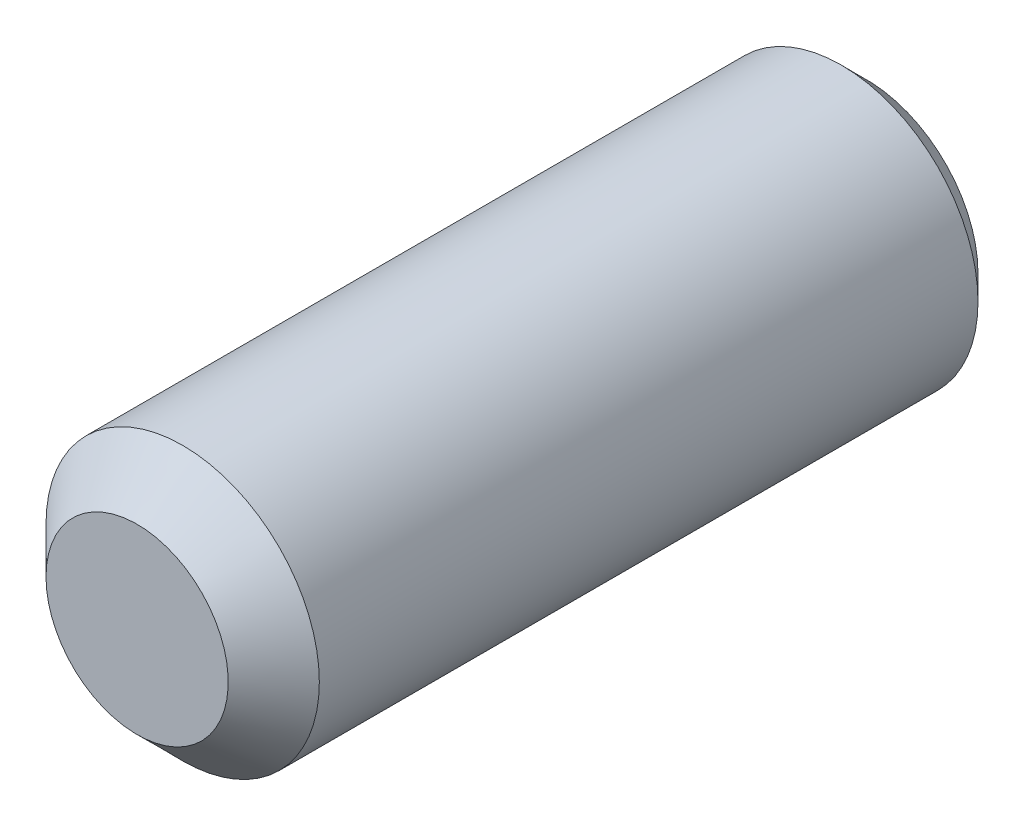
ISO-10303-21;
HEADER;
FILE_DESCRIPTION(('STEP AP214'),'2;1');
FILE_NAME('part.step','',(''),(''),'','','');
FILE_SCHEMA(('AUTOMOTIVE_DESIGN { 1 0 10303 214 1 1 1 1 }'));
ENDSEC;
DATA;
#1=APPLICATION_CONTEXT('core data for automotive mechanical design processes');
#2=APPLICATION_PROTOCOL_DEFINITION('international standard','automotive_design',2000,#1);
#3=PRODUCT_CONTEXT('',#1,'mechanical');
#4=PRODUCT('Part','Part','',(#3));
#5=PRODUCT_RELATED_PRODUCT_CATEGORY('part','',(#4));
#6=PRODUCT_DEFINITION_FORMATION('','',#4);
#7=PRODUCT_DEFINITION_CONTEXT('part definition',#1,'design');
#8=PRODUCT_DEFINITION('design','',#6,#7);
#9=PRODUCT_DEFINITION_SHAPE('','',#8);
#10=(LENGTH_UNIT() NAMED_UNIT(*) SI_UNIT(.MILLI.,.METRE.));
#11=(NAMED_UNIT(*) PLANE_ANGLE_UNIT() SI_UNIT($,.RADIAN.));
#12=(NAMED_UNIT(*) SI_UNIT($,.STERADIAN.) SOLID_ANGLE_UNIT());
#13=UNCERTAINTY_MEASURE_WITH_UNIT(LENGTH_MEASURE(1.E-05),#10,'distance_accuracy_value','');
#14=(GEOMETRIC_REPRESENTATION_CONTEXT(3) GLOBAL_UNCERTAINTY_ASSIGNED_CONTEXT((#13)) GLOBAL_UNIT_ASSIGNED_CONTEXT((#10,
#11,#12)) REPRESENTATION_CONTEXT('',''));
#15=CARTESIAN_POINT('',(0.,0.,0.));
#16=DIRECTION('',(0.,0.,1.));
#17=DIRECTION('',(1.,0.,0.));
#18=AXIS2_PLACEMENT_3D('',#15,#16,#17);
#19=CARTESIAN_POINT('',(0.,0.,8.));
#20=DIRECTION('',(0.,0.,-1.));
#21=DIRECTION('',(-1.,0.,0.));
#22=AXIS2_PLACEMENT_3D('',#19,#20,#21);
#23=CYLINDRICAL_SURFACE('',#22,1.5);
#24=CARTESIAN_POINT('',(0.,0.,0.270624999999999));
#25=DIRECTION('',(0.,0.,1.));
#26=DIRECTION('',(1.,0.,0.));
#27=AXIS2_PLACEMENT_3D('',#24,#25,#26);
#28=CIRCLE('',#27,1.5);
#29=CARTESIAN_POINT('',(1.5,0.,0.270624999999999));
#30=VERTEX_POINT('',#29);
#31=EDGE_CURVE('E40',#30,#30,#28,.T.);
#32=ORIENTED_EDGE('',*,*,#31,.T.);
#33=EDGE_LOOP('',(#32));
#34=FACE_BOUND('',#33,.T.);
#35=CARTESIAN_POINT('',(0.,0.,7.5));
#36=DIRECTION('',(0.,0.,-1.));
#37=DIRECTION('',(-1.,0.,0.));
#38=AXIS2_PLACEMENT_3D('',#35,#36,#37);
#39=CIRCLE('',#38,1.5);
#40=CARTESIAN_POINT('',(-1.5,0.,7.5));
#41=VERTEX_POINT('',#40);
#42=EDGE_CURVE('E146',#41,#41,#39,.T.);
#43=ORIENTED_EDGE('',*,*,#42,.T.);
#44=EDGE_LOOP('',(#43));
#45=FACE_BOUND('',#44,.T.);
#46=ADVANCED_FACE('F33',(#34,#45),#23,.T.);
#47=CARTESIAN_POINT('',(0.,0.,0.));
#48=DIRECTION('',(0.,0.,1.));
#49=DIRECTION('',(1.,0.,0.));
#50=AXIS2_PLACEMENT_3D('',#47,#48,#49);
#51=PLANE('',#50);
#52=DIRECTION('',(-0.499999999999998,-0.86602540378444,0.));
#53=VECTOR('',#52,1.);
#54=CARTESIAN_POINT('',(0.433012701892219,-0.75,0.));
#55=LINE('',#54,#53);
#56=CARTESIAN_POINT('',(0.866025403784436,0.,0.));
#57=VERTEX_POINT('',#56);
#58=CARTESIAN_POINT('',(0.433012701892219,-0.75,0.));
#59=VERTEX_POINT('',#58);
#60=EDGE_CURVE('E47',#57,#59,#55,.T.);
#61=ORIENTED_EDGE('',*,*,#60,.F.);
#62=DIRECTION('',(0.499999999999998,-0.86602540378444,0.));
#63=VECTOR('',#62,1.);
#64=CARTESIAN_POINT('',(0.866025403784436,0.,0.));
#65=LINE('',#64,#63);
#66=CARTESIAN_POINT('',(0.433012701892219,0.75,0.));
#67=VERTEX_POINT('',#66);
#68=EDGE_CURVE('E124',#67,#57,#65,.T.);
#69=ORIENTED_EDGE('',*,*,#68,.F.);
#70=DIRECTION('',(1.,0.,0.));
#71=VECTOR('',#70,1.);
#72=CARTESIAN_POINT('',(0.433012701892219,0.75,0.));
#73=LINE('',#72,#71);
#74=CARTESIAN_POINT('',(-0.433012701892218,0.75,0.));
#75=VERTEX_POINT('',#74);
#76=EDGE_CURVE('E351',#75,#67,#73,.T.);
#77=ORIENTED_EDGE('',*,*,#76,.F.);
#78=DIRECTION('',(0.499999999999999,0.866025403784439,0.));
#79=VECTOR('',#78,1.);
#80=CARTESIAN_POINT('',(-0.433012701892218,0.75,0.));
#81=LINE('',#80,#79);
#82=CARTESIAN_POINT('',(-0.866025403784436,0.,0.));
#83=VERTEX_POINT('',#82);
#84=EDGE_CURVE('E345',#83,#75,#81,.T.);
#85=ORIENTED_EDGE('',*,*,#84,.F.);
#86=DIRECTION('',(-0.499999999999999,0.866025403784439,0.));
#87=VECTOR('',#86,1.);
#88=CARTESIAN_POINT('',(-0.866025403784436,0.,0.));
#89=LINE('',#88,#87);
#90=CARTESIAN_POINT('',(-0.433012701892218,-0.75,0.));
#91=VERTEX_POINT('',#90);
#92=EDGE_CURVE('E108',#91,#83,#89,.T.);
#93=ORIENTED_EDGE('',*,*,#92,.F.);
#94=DIRECTION('',(-1.,0.,0.));
#95=VECTOR('',#94,1.);
#96=CARTESIAN_POINT('',(-0.433012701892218,-0.75,0.));
#97=LINE('',#96,#95);
#98=EDGE_CURVE('E104',#59,#91,#97,.T.);
#99=ORIENTED_EDGE('',*,*,#98,.F.);
#100=EDGE_LOOP('',(#61,#69,#77,#85,#93,#99));
#101=FACE_BOUND('',#100,.T.);
#102=CARTESIAN_POINT('',(0.,0.,0.));
#103=DIRECTION('',(0.,0.,1.));
#104=DIRECTION('',(1.,0.,0.));
#105=AXIS2_PLACEMENT_3D('',#102,#103,#104);
#106=CIRCLE('',#105,1.229375);
#107=CARTESIAN_POINT('',(1.229375,0.,0.));
#108=VERTEX_POINT('',#107);
#109=EDGE_CURVE('E11',#108,#108,#106,.F.);
#110=ORIENTED_EDGE('',*,*,#109,.T.);
#111=EDGE_LOOP('',(#110));
#112=FACE_BOUND('',#111,.T.);
#113=ADVANCED_FACE('F105',(#101,#112),#51,.F.);
#114=CARTESIAN_POINT('',(0.,0.,0.270624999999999));
#115=DIRECTION('',(0.,0.,1.));
#116=DIRECTION('',(1.,0.,0.));
#117=AXIS2_PLACEMENT_3D('',#114,#115,#116);
#118=CONICAL_SURFACE('',#117,1.5,0.78539816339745);
#119=ORIENTED_EDGE('',*,*,#109,.F.);
#120=EDGE_LOOP('',(#119));
#121=FACE_BOUND('',#120,.T.);
#122=ORIENTED_EDGE('',*,*,#31,.F.);
#123=EDGE_LOOP('',(#122));
#124=FACE_BOUND('',#123,.T.);
#125=ADVANCED_FACE('F153',(#121,#124),#118,.T.);
#126=CARTESIAN_POINT('',(0.,0.,7.5));
#127=DIRECTION('',(0.,0.,-1.));
#128=DIRECTION('',(-1.,0.,0.));
#129=AXIS2_PLACEMENT_3D('',#126,#127,#128);
#130=CONICAL_SURFACE('',#129,1.5,0.785398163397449);
#131=CARTESIAN_POINT('',(0.,0.,8.));
#132=DIRECTION('',(0.,0.,-1.));
#133=DIRECTION('',(-1.,0.,0.));
#134=AXIS2_PLACEMENT_3D('',#131,#132,#133);
#135=CIRCLE('',#134,0.999999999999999);
#136=CARTESIAN_POINT('',(-0.999999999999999,0.,8.));
#137=VERTEX_POINT('',#136);
#138=EDGE_CURVE('E141',#137,#137,#135,.T.);
#139=ORIENTED_EDGE('',*,*,#138,.T.);
#140=EDGE_LOOP('',(#139));
#141=FACE_BOUND('',#140,.T.);
#142=ORIENTED_EDGE('',*,*,#42,.F.);
#143=EDGE_LOOP('',(#142));
#144=FACE_BOUND('',#143,.T.);
#145=ADVANCED_FACE('F155',(#141,#144),#130,.T.);
#146=CARTESIAN_POINT('',(0.,0.,8.));
#147=DIRECTION('',(0.,0.,1.));
#148=DIRECTION('',(1.,0.,0.));
#149=AXIS2_PLACEMENT_3D('',#146,#147,#148);
#150=PLANE('',#149);
#151=ORIENTED_EDGE('',*,*,#138,.F.);
#152=EDGE_LOOP('',(#151));
#153=FACE_BOUND('',#152,.T.);
#154=ADVANCED_FACE('F162',(#153),#150,.T.);
#155=CARTESIAN_POINT('',(0.866025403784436,0.,2.));
#156=DIRECTION('',(0.86602540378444,0.499999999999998,0.));
#157=DIRECTION('',(-0.499999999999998,0.86602540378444,0.));
#158=AXIS2_PLACEMENT_3D('',#155,#156,#157);
#159=PLANE('',#158);
#160=ORIENTED_EDGE('',*,*,#68,.T.);
#161=DIRECTION('',(0.,0.,-1.));
#162=VECTOR('',#161,1.);
#163=CARTESIAN_POINT('',(0.866025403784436,0.,2.));
#164=LINE('',#163,#162);
#165=CARTESIAN_POINT('',(0.866025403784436,0.,2.));
#166=VERTEX_POINT('',#165);
#167=EDGE_CURVE('E122',#166,#57,#164,.T.);
#168=ORIENTED_EDGE('',*,*,#167,.F.);
#169=DIRECTION('',(0.499999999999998,-0.86602540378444,0.));
#170=VECTOR('',#169,1.);
#171=CARTESIAN_POINT('',(0.866025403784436,0.,2.));
#172=LINE('',#171,#170);
#173=CARTESIAN_POINT('',(0.649519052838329,0.374999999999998,2.));
#174=VERTEX_POINT('',#173);
#175=EDGE_CURVE('E356',#174,#166,#172,.T.);
#176=ORIENTED_EDGE('',*,*,#175,.F.);
#177=CARTESIAN_POINT('',(0.433012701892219,0.75,2.));
#178=VERTEX_POINT('',#177);
#179=EDGE_CURVE('E357',#178,#174,#172,.T.);
#180=ORIENTED_EDGE('',*,*,#179,.F.);
#181=DIRECTION('',(0.,0.,-1.));
#182=VECTOR('',#181,1.);
#183=CARTESIAN_POINT('',(0.433012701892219,0.75,2.));
#184=LINE('',#183,#182);
#185=EDGE_CURVE('E338',#178,#67,#184,.T.);
#186=ORIENTED_EDGE('',*,*,#185,.T.);
#187=EDGE_LOOP('',(#160,#168,#176,#180,#186));
#188=FACE_BOUND('',#187,.T.);
#189=ADVANCED_FACE('F185',(#188),#159,.F.);
#190=CARTESIAN_POINT('',(0.433012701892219,0.75,2.));
#191=DIRECTION('',(0.,1.,0.));
#192=DIRECTION('',(-1.,0.,0.));
#193=AXIS2_PLACEMENT_3D('',#190,#191,#192);
#194=PLANE('',#193);
#195=ORIENTED_EDGE('',*,*,#76,.T.);
#196=ORIENTED_EDGE('',*,*,#185,.F.);
#197=DIRECTION('',(1.,0.,0.));
#198=VECTOR('',#197,1.);
#199=CARTESIAN_POINT('',(0.433012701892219,0.75,2.));
#200=LINE('',#199,#198);
#201=CARTESIAN_POINT('',(0.,0.75,2.));
#202=VERTEX_POINT('',#201);
#203=EDGE_CURVE('E333',#202,#178,#200,.T.);
#204=ORIENTED_EDGE('',*,*,#203,.F.);
#205=CARTESIAN_POINT('',(-0.433012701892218,0.75,2.));
#206=VERTEX_POINT('',#205);
#207=EDGE_CURVE('E134',#206,#202,#200,.T.);
#208=ORIENTED_EDGE('',*,*,#207,.F.);
#209=DIRECTION('',(0.,0.,-1.));
#210=VECTOR('',#209,1.);
#211=CARTESIAN_POINT('',(-0.433012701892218,0.75,2.));
#212=LINE('',#211,#210);
#213=EDGE_CURVE('E341',#206,#75,#212,.T.);
#214=ORIENTED_EDGE('',*,*,#213,.T.);
#215=EDGE_LOOP('',(#195,#196,#204,#208,#214));
#216=FACE_BOUND('',#215,.T.);
#217=ADVANCED_FACE('F190',(#216),#194,.F.);
#218=CARTESIAN_POINT('',(-0.433012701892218,0.75,2.));
#219=DIRECTION('',(-0.866025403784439,0.499999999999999,0.));
#220=DIRECTION('',(-0.499999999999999,-0.866025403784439,0.));
#221=AXIS2_PLACEMENT_3D('',#218,#219,#220);
#222=PLANE('',#221);
#223=ORIENTED_EDGE('',*,*,#84,.T.);
#224=ORIENTED_EDGE('',*,*,#213,.F.);
#225=DIRECTION('',(0.499999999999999,0.866025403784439,0.));
#226=VECTOR('',#225,1.);
#227=CARTESIAN_POINT('',(-0.433012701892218,0.75,2.));
#228=LINE('',#227,#226);
#229=CARTESIAN_POINT('',(-0.649519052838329,0.374999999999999,2.));
#230=VERTEX_POINT('',#229);
#231=EDGE_CURVE('E328',#230,#206,#228,.T.);
#232=ORIENTED_EDGE('',*,*,#231,.F.);
#233=CARTESIAN_POINT('',(-0.866025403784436,0.,2.));
#234=VERTEX_POINT('',#233);
#235=EDGE_CURVE('E55',#234,#230,#228,.T.);
#236=ORIENTED_EDGE('',*,*,#235,.F.);
#237=DIRECTION('',(0.,0.,-1.));
#238=VECTOR('',#237,1.);
#239=CARTESIAN_POINT('',(-0.866025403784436,0.,2.));
#240=LINE('',#239,#238);
#241=EDGE_CURVE('E132',#234,#83,#240,.T.);
#242=ORIENTED_EDGE('',*,*,#241,.T.);
#243=EDGE_LOOP('',(#223,#224,#232,#236,#242));
#244=FACE_BOUND('',#243,.T.);
#245=ADVANCED_FACE('F201',(#244),#222,.F.);
#246=CARTESIAN_POINT('',(-0.866025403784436,0.,2.));
#247=DIRECTION('',(-0.866025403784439,-0.499999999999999,0.));
#248=DIRECTION('',(0.499999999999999,-0.866025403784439,0.));
#249=AXIS2_PLACEMENT_3D('',#246,#247,#248);
#250=PLANE('',#249);
#251=ORIENTED_EDGE('',*,*,#92,.T.);
#252=ORIENTED_EDGE('',*,*,#241,.F.);
#253=DIRECTION('',(-0.499999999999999,0.866025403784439,0.));
#254=VECTOR('',#253,1.);
#255=CARTESIAN_POINT('',(-0.866025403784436,0.,2.));
#256=LINE('',#255,#254);
#257=CARTESIAN_POINT('',(-0.649519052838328,-0.374999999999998,2.));
#258=VERTEX_POINT('',#257);
#259=EDGE_CURVE('E348',#258,#234,#256,.T.);
#260=ORIENTED_EDGE('',*,*,#259,.F.);
#261=CARTESIAN_POINT('',(-0.433012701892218,-0.75,2.));
#262=VERTEX_POINT('',#261);
#263=EDGE_CURVE('E365',#262,#258,#256,.T.);
#264=ORIENTED_EDGE('',*,*,#263,.F.);
#265=DIRECTION('',(0.,0.,-1.));
#266=VECTOR('',#265,1.);
#267=CARTESIAN_POINT('',(-0.433012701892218,-0.75,2.));
#268=LINE('',#267,#266);
#269=EDGE_CURVE('E130',#262,#91,#268,.T.);
#270=ORIENTED_EDGE('',*,*,#269,.T.);
#271=EDGE_LOOP('',(#251,#252,#260,#264,#270));
#272=FACE_BOUND('',#271,.T.);
#273=ADVANCED_FACE('F211',(#272),#250,.F.);
#274=CARTESIAN_POINT('',(-0.433012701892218,-0.75,2.));
#275=DIRECTION('',(0.,-1.,0.));
#276=DIRECTION('',(0.,0.,-1.));
#277=AXIS2_PLACEMENT_3D('',#274,#275,#276);
#278=PLANE('',#277);
#279=ORIENTED_EDGE('',*,*,#98,.T.);
#280=ORIENTED_EDGE('',*,*,#269,.F.);
#281=DIRECTION('',(-1.,0.,0.));
#282=VECTOR('',#281,1.);
#283=CARTESIAN_POINT('',(-0.433012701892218,-0.75,2.));
#284=LINE('',#283,#282);
#285=CARTESIAN_POINT('',(0.,-0.75,2.));
#286=VERTEX_POINT('',#285);
#287=EDGE_CURVE('E364',#286,#262,#284,.T.);
#288=ORIENTED_EDGE('',*,*,#287,.F.);
#289=CARTESIAN_POINT('',(0.433012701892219,-0.75,2.));
#290=VERTEX_POINT('',#289);
#291=EDGE_CURVE('E129',#290,#286,#284,.T.);
#292=ORIENTED_EDGE('',*,*,#291,.F.);
#293=DIRECTION('',(0.,0.,-1.));
#294=VECTOR('',#293,1.);
#295=CARTESIAN_POINT('',(0.433012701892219,-0.75,2.));
#296=LINE('',#295,#294);
#297=EDGE_CURVE('E118',#290,#59,#296,.T.);
#298=ORIENTED_EDGE('',*,*,#297,.T.);
#299=EDGE_LOOP('',(#279,#280,#288,#292,#298));
#300=FACE_BOUND('',#299,.T.);
#301=ADVANCED_FACE('F126',(#300),#278,.F.);
#302=CARTESIAN_POINT('',(0.433012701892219,-0.75,2.));
#303=DIRECTION('',(0.86602540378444,-0.499999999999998,0.));
#304=DIRECTION('',(0.499999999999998,0.86602540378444,0.));
#305=AXIS2_PLACEMENT_3D('',#302,#303,#304);
#306=PLANE('',#305);
#307=ORIENTED_EDGE('',*,*,#60,.T.);
#308=ORIENTED_EDGE('',*,*,#297,.F.);
#309=DIRECTION('',(-0.499999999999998,-0.86602540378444,0.));
#310=VECTOR('',#309,1.);
#311=CARTESIAN_POINT('',(0.433012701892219,-0.75,2.));
#312=LINE('',#311,#310);
#313=CARTESIAN_POINT('',(0.649519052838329,-0.374999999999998,2.));
#314=VERTEX_POINT('',#313);
#315=EDGE_CURVE('E360',#314,#290,#312,.T.);
#316=ORIENTED_EDGE('',*,*,#315,.F.);
#317=EDGE_CURVE('E361',#166,#314,#312,.T.);
#318=ORIENTED_EDGE('',*,*,#317,.F.);
#319=ORIENTED_EDGE('',*,*,#167,.T.);
#320=EDGE_LOOP('',(#307,#308,#316,#318,#319));
#321=FACE_BOUND('',#320,.T.);
#322=ADVANCED_FACE('F116',(#321),#306,.F.);
#323=CARTESIAN_POINT('',(1.29903810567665,-0.75,2.));
#324=DIRECTION('',(0.,0.,-1.));
#325=DIRECTION('',(-1.,0.,0.));
#326=AXIS2_PLACEMENT_3D('',#323,#324,#325);
#327=PLANE('',#326);
#328=CARTESIAN_POINT('',(0.,0.,2.));
#329=DIRECTION('',(0.,0.,-1.));
#330=DIRECTION('',(-1.,0.,0.));
#331=AXIS2_PLACEMENT_3D('',#328,#329,#330);
#332=CIRCLE('',#331,0.75);
#333=EDGE_CURVE('E366',#286,#258,#332,.T.);
#334=ORIENTED_EDGE('',*,*,#333,.F.);
#335=ORIENTED_EDGE('',*,*,#287,.T.);
#336=ORIENTED_EDGE('',*,*,#263,.T.);
#337=EDGE_LOOP('',(#334,#335,#336));
#338=FACE_BOUND('',#337,.T.);
#339=ADVANCED_FACE('F238',(#338),#327,.T.);
#340=EDGE_CURVE('E367',#314,#286,#332,.T.);
#341=ORIENTED_EDGE('',*,*,#340,.F.);
#342=ORIENTED_EDGE('',*,*,#315,.T.);
#343=ORIENTED_EDGE('',*,*,#291,.T.);
#344=EDGE_LOOP('',(#341,#342,#343));
#345=FACE_BOUND('',#344,.T.);
#346=ADVANCED_FACE('F247',(#345),#327,.T.);
#347=EDGE_CURVE('E369',#174,#314,#332,.T.);
#348=ORIENTED_EDGE('',*,*,#347,.F.);
#349=ORIENTED_EDGE('',*,*,#175,.T.);
#350=ORIENTED_EDGE('',*,*,#317,.T.);
#351=EDGE_LOOP('',(#348,#349,#350));
#352=FACE_BOUND('',#351,.T.);
#353=ADVANCED_FACE('F258',(#352),#327,.T.);
#354=EDGE_CURVE('E142',#202,#174,#332,.T.);
#355=ORIENTED_EDGE('',*,*,#354,.F.);
#356=ORIENTED_EDGE('',*,*,#203,.T.);
#357=ORIENTED_EDGE('',*,*,#179,.T.);
#358=EDGE_LOOP('',(#355,#356,#357));
#359=FACE_BOUND('',#358,.T.);
#360=ADVANCED_FACE('F267',(#359),#327,.T.);
#361=EDGE_CURVE('E138',#230,#202,#332,.T.);
#362=ORIENTED_EDGE('',*,*,#361,.F.);
#363=ORIENTED_EDGE('',*,*,#231,.T.);
#364=ORIENTED_EDGE('',*,*,#207,.T.);
#365=EDGE_LOOP('',(#362,#363,#364));
#366=FACE_BOUND('',#365,.T.);
#367=ADVANCED_FACE('F276',(#366),#327,.T.);
#368=EDGE_CURVE('E143',#258,#230,#332,.T.);
#369=ORIENTED_EDGE('',*,*,#368,.F.);
#370=ORIENTED_EDGE('',*,*,#259,.T.);
#371=ORIENTED_EDGE('',*,*,#235,.T.);
#372=EDGE_LOOP('',(#369,#370,#371));
#373=FACE_BOUND('',#372,.T.);
#374=ADVANCED_FACE('F250',(#373),#327,.T.);
#375=CARTESIAN_POINT('',(0.,0.,2.));
#376=DIRECTION('',(0.,0.,-1.));
#377=DIRECTION('',(-1.,0.,0.));
#378=AXIS2_PLACEMENT_3D('',#375,#376,#377);
#379=CONICAL_SURFACE('',#378,0.75,1.04719755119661);
#380=CARTESIAN_POINT('',(0.,0.,2.4330127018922));
#381=VERTEX_POINT('',#380);
#382=VERTEX_LOOP('',#381);
#383=FACE_BOUND('',#382,.T.);
#384=ORIENTED_EDGE('',*,*,#361,.T.);
#385=ORIENTED_EDGE('',*,*,#354,.T.);
#386=ORIENTED_EDGE('',*,*,#347,.T.);
#387=ORIENTED_EDGE('',*,*,#340,.T.);
#388=ORIENTED_EDGE('',*,*,#333,.T.);
#389=ORIENTED_EDGE('',*,*,#368,.T.);
#390=EDGE_LOOP('',(#384,#385,#386,#387,#388,#389));
#391=FACE_BOUND('',#390,.T.);
#392=ADVANCED_FACE('F293',(#383,#391),#379,.F.);
#393=CLOSED_SHELL('',(#46,#113,#125,#145,#154,#189,#217,#245,#273,#301,#322,#339,#346,#353,#360,
#367,#374,#392));
#394=MANIFOLD_SOLID_BREP('B2',#393);
#395=ADVANCED_BREP_SHAPE_REPRESENTATION('',(#18,#394),#14);
#396=SHAPE_DEFINITION_REPRESENTATION(#9,#395);
ENDSEC;
END-ISO-10303-21;
